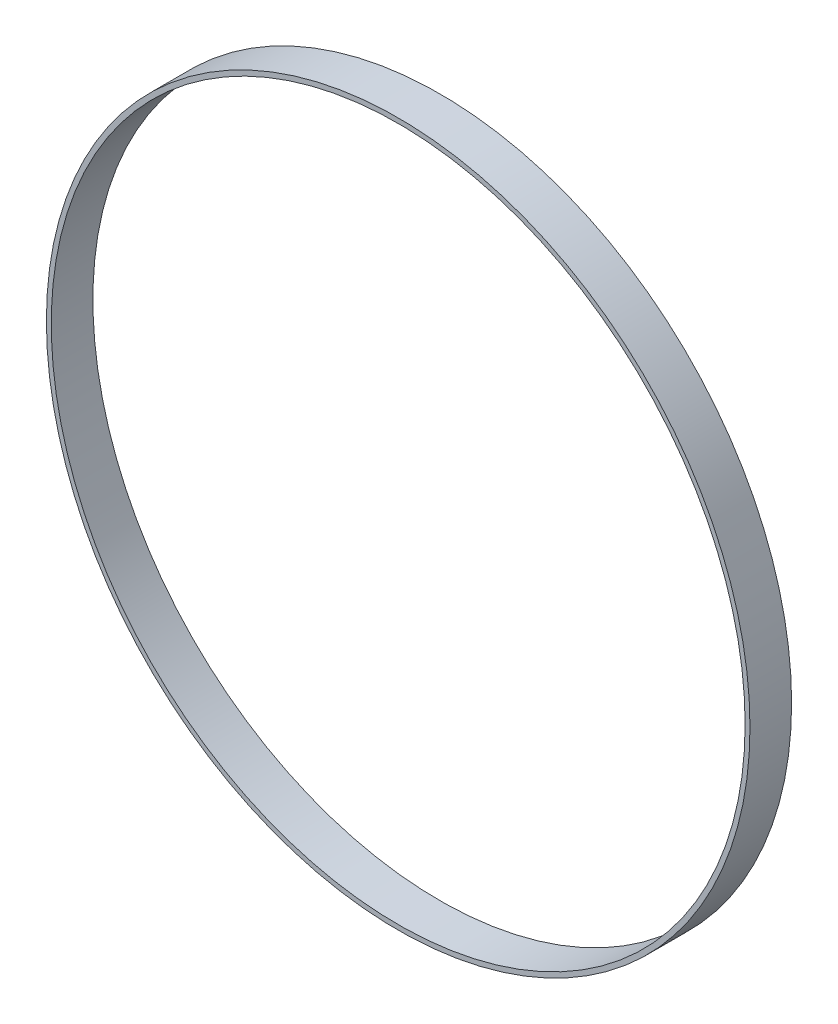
ISO-10303-21;
HEADER;
FILE_DESCRIPTION(('STEP AP214'),'2;1');
FILE_NAME('part.step','',(''),(''),'','','');
FILE_SCHEMA(('AUTOMOTIVE_DESIGN { 1 0 10303 214 1 1 1 1 }'));
ENDSEC;
DATA;
#1=APPLICATION_CONTEXT('core data for automotive mechanical design processes');
#2=APPLICATION_PROTOCOL_DEFINITION('international standard','automotive_design',2000,#1);
#3=PRODUCT_CONTEXT('',#1,'mechanical');
#4=PRODUCT('Part','Part','',(#3));
#5=PRODUCT_RELATED_PRODUCT_CATEGORY('part','',(#4));
#6=PRODUCT_DEFINITION_FORMATION('','',#4);
#7=PRODUCT_DEFINITION_CONTEXT('part definition',#1,'design');
#8=PRODUCT_DEFINITION('design','',#6,#7);
#9=PRODUCT_DEFINITION_SHAPE('','',#8);
#10=(LENGTH_UNIT() NAMED_UNIT(*) SI_UNIT(.MILLI.,.METRE.));
#11=(NAMED_UNIT(*) PLANE_ANGLE_UNIT() SI_UNIT($,.RADIAN.));
#12=(NAMED_UNIT(*) SI_UNIT($,.STERADIAN.) SOLID_ANGLE_UNIT());
#13=UNCERTAINTY_MEASURE_WITH_UNIT(LENGTH_MEASURE(1.E-05),#10,'distance_accuracy_value','');
#14=(GEOMETRIC_REPRESENTATION_CONTEXT(3) GLOBAL_UNCERTAINTY_ASSIGNED_CONTEXT((#13)) GLOBAL_UNIT_ASSIGNED_CONTEXT((#10,
#11,#12)) REPRESENTATION_CONTEXT('',''));
#15=CARTESIAN_POINT('',(0.,0.,0.));
#16=DIRECTION('',(0.,0.,1.));
#17=DIRECTION('',(1.,0.,0.));
#18=AXIS2_PLACEMENT_3D('',#15,#16,#17);
#19=CARTESIAN_POINT('',(0.,0.,6.));
#20=DIRECTION('',(0.,0.,1.));
#21=DIRECTION('',(1.,0.,0.));
#22=AXIS2_PLACEMENT_3D('',#19,#20,#21);
#23=PLANE('',#22);
#24=CARTESIAN_POINT('',(0.,0.,6.));
#25=DIRECTION('',(0.,0.,1.));
#26=DIRECTION('',(1.,0.,0.));
#27=AXIS2_PLACEMENT_3D('',#24,#25,#26);
#28=CIRCLE('',#27,50.7);
#29=CARTESIAN_POINT('',(50.7,0.,6.));
#30=VERTEX_POINT('',#29);
#31=EDGE_CURVE('E10',#30,#30,#28,.T.);
#32=ORIENTED_EDGE('',*,*,#31,.T.);
#33=EDGE_LOOP('',(#32));
#34=FACE_BOUND('',#33,.T.);
#35=CARTESIAN_POINT('',(0.,0.,6.));
#36=DIRECTION('',(0.,0.,1.));
#37=DIRECTION('',(1.,0.,0.));
#38=AXIS2_PLACEMENT_3D('',#35,#36,#37);
#39=CIRCLE('',#38,50.);
#40=CARTESIAN_POINT('',(50.,0.,6.));
#41=VERTEX_POINT('',#40);
#42=EDGE_CURVE('E40',#41,#41,#39,.T.);
#43=ORIENTED_EDGE('',*,*,#42,.F.);
#44=EDGE_LOOP('',(#43));
#45=FACE_BOUND('',#44,.T.);
#46=ADVANCED_FACE('F29',(#34,#45),#23,.T.);
#47=CARTESIAN_POINT('',(0.,0.,0.));
#48=DIRECTION('',(0.,0.,1.));
#49=DIRECTION('',(1.,0.,0.));
#50=AXIS2_PLACEMENT_3D('',#47,#48,#49);
#51=PLANE('',#50);
#52=CARTESIAN_POINT('',(0.,0.,0.));
#53=DIRECTION('',(0.,0.,1.));
#54=DIRECTION('',(1.,0.,0.));
#55=AXIS2_PLACEMENT_3D('',#52,#53,#54);
#56=CIRCLE('',#55,50.7);
#57=CARTESIAN_POINT('',(50.7,0.,0.));
#58=VERTEX_POINT('',#57);
#59=EDGE_CURVE('E36',#58,#58,#56,.T.);
#60=ORIENTED_EDGE('',*,*,#59,.F.);
#61=EDGE_LOOP('',(#60));
#62=FACE_BOUND('',#61,.T.);
#63=CARTESIAN_POINT('',(0.,0.,0.));
#64=DIRECTION('',(0.,0.,1.));
#65=DIRECTION('',(1.,0.,0.));
#66=AXIS2_PLACEMENT_3D('',#63,#64,#65);
#67=CIRCLE('',#66,50.);
#68=CARTESIAN_POINT('',(50.,0.,0.));
#69=VERTEX_POINT('',#68);
#70=EDGE_CURVE('E44',#69,#69,#67,.T.);
#71=ORIENTED_EDGE('',*,*,#70,.T.);
#72=EDGE_LOOP('',(#71));
#73=FACE_BOUND('',#72,.T.);
#74=ADVANCED_FACE('F50',(#62,#73),#51,.F.);
#75=CARTESIAN_POINT('',(0.,0.,6.));
#76=DIRECTION('',(0.,0.,-1.));
#77=DIRECTION('',(-1.,0.,0.));
#78=AXIS2_PLACEMENT_3D('',#75,#76,#77);
#79=CYLINDRICAL_SURFACE('',#78,50.7);
#80=ORIENTED_EDGE('',*,*,#31,.F.);
#81=EDGE_LOOP('',(#80));
#82=FACE_BOUND('',#81,.T.);
#83=ORIENTED_EDGE('',*,*,#59,.T.);
#84=EDGE_LOOP('',(#83));
#85=FACE_BOUND('',#84,.T.);
#86=ADVANCED_FACE('F31',(#82,#85),#79,.T.);
#87=CARTESIAN_POINT('',(0.,0.,6.));
#88=DIRECTION('',(0.,0.,-1.));
#89=DIRECTION('',(-1.,0.,0.));
#90=AXIS2_PLACEMENT_3D('',#87,#88,#89);
#91=CYLINDRICAL_SURFACE('',#90,50.);
#92=ORIENTED_EDGE('',*,*,#42,.T.);
#93=EDGE_LOOP('',(#92));
#94=FACE_BOUND('',#93,.T.);
#95=ORIENTED_EDGE('',*,*,#70,.F.);
#96=EDGE_LOOP('',(#95));
#97=FACE_BOUND('',#96,.T.);
#98=ADVANCED_FACE('F52',(#94,#97),#91,.F.);
#99=CLOSED_SHELL('',(#46,#74,#86,#98));
#100=MANIFOLD_SOLID_BREP('B2',#99);
#101=ADVANCED_BREP_SHAPE_REPRESENTATION('',(#18,#100),#14);
#102=SHAPE_DEFINITION_REPRESENTATION(#9,#101);
ENDSEC;
END-ISO-10303-21;
